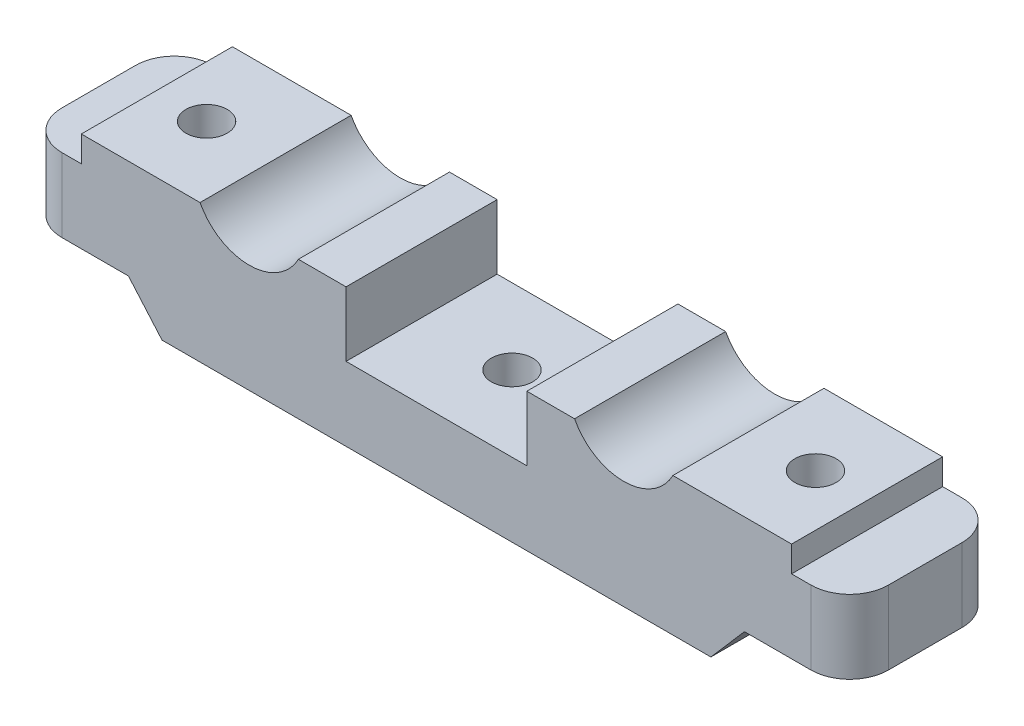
ISO-10303-21;
HEADER;
FILE_DESCRIPTION(('STEP AP214'),'2;1');
FILE_NAME('part.step','',(''),(''),'','','');
FILE_SCHEMA(('AUTOMOTIVE_DESIGN { 1 0 10303 214 1 1 1 1 }'));
ENDSEC;
DATA;
#1=APPLICATION_CONTEXT('core data for automotive mechanical design processes');
#2=APPLICATION_PROTOCOL_DEFINITION('international standard','automotive_design',2000,#1);
#3=PRODUCT_CONTEXT('',#1,'mechanical');
#4=PRODUCT('Part','Part','',(#3));
#5=PRODUCT_RELATED_PRODUCT_CATEGORY('part','',(#4));
#6=PRODUCT_DEFINITION_FORMATION('','',#4);
#7=PRODUCT_DEFINITION_CONTEXT('part definition',#1,'design');
#8=PRODUCT_DEFINITION('design','',#6,#7);
#9=PRODUCT_DEFINITION_SHAPE('','',#8);
#10=(LENGTH_UNIT() NAMED_UNIT(*) SI_UNIT(.MILLI.,.METRE.));
#11=(NAMED_UNIT(*) PLANE_ANGLE_UNIT() SI_UNIT($,.RADIAN.));
#12=(NAMED_UNIT(*) SI_UNIT($,.STERADIAN.) SOLID_ANGLE_UNIT());
#13=UNCERTAINTY_MEASURE_WITH_UNIT(LENGTH_MEASURE(1.E-05),#10,'distance_accuracy_value','');
#14=(GEOMETRIC_REPRESENTATION_CONTEXT(3) GLOBAL_UNCERTAINTY_ASSIGNED_CONTEXT((#13)) GLOBAL_UNIT_ASSIGNED_CONTEXT((#10,
#11,#12)) REPRESENTATION_CONTEXT('',''));
#15=CARTESIAN_POINT('',(0.,0.,0.));
#16=DIRECTION('',(0.,0.,1.));
#17=DIRECTION('',(1.,0.,0.));
#18=AXIS2_PLACEMENT_3D('',#15,#16,#17);
#19=CARTESIAN_POINT('',(-23.85,3.,11.7));
#20=DIRECTION('',(0.755689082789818,0.654930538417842,0.));
#21=DIRECTION('',(-0.654930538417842,0.755689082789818,0.));
#22=AXIS2_PLACEMENT_3D('',#19,#20,#21);
#23=PLANE('',#22);
#24=DIRECTION('',(0.,0.,-1.));
#25=VECTOR('',#24,1.);
#26=CARTESIAN_POINT('',(-21.25,0.,11.7));
#27=LINE('',#26,#25);
#28=CARTESIAN_POINT('',(-21.25,0.,3.06273937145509));
#29=VERTEX_POINT('',#28);
#30=CARTESIAN_POINT('',(-21.25,0.,0.));
#31=VERTEX_POINT('',#30);
#32=EDGE_CURVE('E234',#29,#31,#27,.T.);
#33=ORIENTED_EDGE('',*,*,#32,.F.);
#34=CARTESIAN_POINT('',(-23.5,2.59615384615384,5.99999999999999));
#35=DIRECTION('',(0.755689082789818,0.654930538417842,0.));
#36=DIRECTION('',(0.654930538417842,-0.755689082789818,0.));
#37=AXIS2_PLACEMENT_3D('',#34,#35,#36);
#38=ELLIPSE('',#37,5.64945407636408,3.7);
#39=CARTESIAN_POINT('',(-23.85,3.,2.31659125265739));
#40=VERTEX_POINT('',#39);
#41=EDGE_CURVE('E214',#29,#40,#38,.T.);
#42=ORIENTED_EDGE('',*,*,#41,.T.);
#43=DIRECTION('',(0.,0.,-1.));
#44=VECTOR('',#43,1.);
#45=CARTESIAN_POINT('',(-23.85,3.,11.7));
#46=LINE('',#45,#44);
#47=CARTESIAN_POINT('',(-23.85,3.,0.));
#48=VERTEX_POINT('',#47);
#49=EDGE_CURVE('E310',#40,#48,#46,.T.);
#50=ORIENTED_EDGE('',*,*,#49,.T.);
#51=DIRECTION('',(0.654930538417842,-0.755689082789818,0.));
#52=VECTOR('',#51,1.);
#53=CARTESIAN_POINT('',(-23.85,3.,0.));
#54=LINE('',#53,#52);
#55=EDGE_CURVE('E447',#48,#31,#54,.T.);
#56=ORIENTED_EDGE('',*,*,#55,.T.);
#57=EDGE_LOOP('',(#33,#42,#50,#56));
#58=FACE_BOUND('',#57,.T.);
#59=ADVANCED_FACE('F30',(#58),#23,.F.);
#60=CARTESIAN_POINT('',(-23.5,13.,5.99999999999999));
#61=DIRECTION('',(0.,-1.,0.));
#62=DIRECTION('',(0.,0.,-1.));
#63=AXIS2_PLACEMENT_3D('',#60,#61,#62);
#64=CYLINDRICAL_SURFACE('',#63,1.6);
#65=CARTESIAN_POINT('',(-23.5,10.7,5.99999999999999));
#66=DIRECTION('',(0.,-1.,0.));
#67=DIRECTION('',(1.,0.,0.));
#68=AXIS2_PLACEMENT_3D('',#65,#66,#67);
#69=CIRCLE('',#68,1.6);
#70=CARTESIAN_POINT('',(-21.9,10.7,5.99999999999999));
#71=VERTEX_POINT('',#70);
#72=EDGE_CURVE('E246',#71,#71,#69,.T.);
#73=ORIENTED_EDGE('',*,*,#72,.F.);
#74=EDGE_LOOP('',(#73));
#75=FACE_BOUND('',#74,.T.);
#76=CARTESIAN_POINT('',(-23.5,6.,5.99999999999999));
#77=DIRECTION('',(0.,-1.,0.));
#78=DIRECTION('',(1.,0.,0.));
#79=AXIS2_PLACEMENT_3D('',#76,#77,#78);
#80=CIRCLE('',#79,1.6);
#81=CARTESIAN_POINT('',(-21.9,6.,5.99999999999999));
#82=VERTEX_POINT('',#81);
#83=EDGE_CURVE('E227',#82,#82,#80,.F.);
#84=ORIENTED_EDGE('',*,*,#83,.F.);
#85=EDGE_LOOP('',(#84));
#86=FACE_BOUND('',#85,.T.);
#87=ADVANCED_FACE('F478',(#75,#86),#64,.F.);
#88=CARTESIAN_POINT('',(-23.85,3.,11.7));
#89=VERTEX_POINT('',#88);
#90=CARTESIAN_POINT('',(-23.85,3.,9.68340874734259));
#91=VERTEX_POINT('',#90);
#92=EDGE_CURVE('E226',#89,#91,#46,.T.);
#93=ORIENTED_EDGE('',*,*,#92,.T.);
#94=CARTESIAN_POINT('',(-21.25,0.,8.9372606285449));
#95=VERTEX_POINT('',#94);
#96=EDGE_CURVE('E211',#91,#95,#38,.T.);
#97=ORIENTED_EDGE('',*,*,#96,.T.);
#98=CARTESIAN_POINT('',(-21.25,0.,11.7));
#99=VERTEX_POINT('',#98);
#100=EDGE_CURVE('E224',#99,#95,#27,.T.);
#101=ORIENTED_EDGE('',*,*,#100,.F.);
#102=DIRECTION('',(0.654930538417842,-0.755689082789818,0.));
#103=VECTOR('',#102,1.);
#104=CARTESIAN_POINT('',(-23.85,3.,11.7));
#105=LINE('',#104,#103);
#106=EDGE_CURVE('E413',#89,#99,#105,.T.);
#107=ORIENTED_EDGE('',*,*,#106,.F.);
#108=EDGE_LOOP('',(#93,#97,#101,#107));
#109=FACE_BOUND('',#108,.T.);
#110=ADVANCED_FACE('F32',(#109),#23,.F.);
#111=CARTESIAN_POINT('',(-21.25,0.,11.7));
#112=DIRECTION('',(0.,1.,0.));
#113=DIRECTION('',(-1.,0.,0.));
#114=AXIS2_PLACEMENT_3D('',#111,#112,#113);
#115=PLANE('',#114);
#116=CARTESIAN_POINT('',(0.,0.,5.84999999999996));
#117=DIRECTION('',(0.,1.,0.));
#118=DIRECTION('',(-1.,0.,0.));
#119=AXIS2_PLACEMENT_3D('',#116,#117,#118);
#120=CIRCLE('',#119,1.6);
#121=CARTESIAN_POINT('',(-1.6,0.,5.84999999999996));
#122=VERTEX_POINT('',#121);
#123=EDGE_CURVE('E250',#122,#122,#120,.T.);
#124=ORIENTED_EDGE('',*,*,#123,.T.);
#125=EDGE_LOOP('',(#124));
#126=FACE_BOUND('',#125,.T.);
#127=ORIENTED_EDGE('',*,*,#100,.T.);
#128=CARTESIAN_POINT('',(-23.5,0.,5.99999999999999));
#129=DIRECTION('',(0.,-1.,0.));
#130=DIRECTION('',(1.,0.,0.));
#131=AXIS2_PLACEMENT_3D('',#128,#129,#130);
#132=CIRCLE('',#131,3.7);
#133=EDGE_CURVE('E208',#29,#95,#132,.T.);
#134=ORIENTED_EDGE('',*,*,#133,.F.);
#135=ORIENTED_EDGE('',*,*,#32,.T.);
#136=DIRECTION('',(1.,0.,0.));
#137=VECTOR('',#136,1.);
#138=CARTESIAN_POINT('',(-21.25,0.,0.));
#139=LINE('',#138,#137);
#140=CARTESIAN_POINT('',(21.25,0.,0.));
#141=VERTEX_POINT('',#140);
#142=EDGE_CURVE('E377',#31,#141,#139,.T.);
#143=ORIENTED_EDGE('',*,*,#142,.T.);
#144=DIRECTION('',(0.,0.,-1.));
#145=VECTOR('',#144,1.);
#146=CARTESIAN_POINT('',(21.25,0.,11.7));
#147=LINE('',#146,#145);
#148=CARTESIAN_POINT('',(21.25,0.,11.7));
#149=VERTEX_POINT('',#148);
#150=EDGE_CURVE('E238',#149,#141,#147,.T.);
#151=ORIENTED_EDGE('',*,*,#150,.F.);
#152=DIRECTION('',(1.,0.,0.));
#153=VECTOR('',#152,1.);
#154=CARTESIAN_POINT('',(-21.25,0.,11.7));
#155=LINE('',#154,#153);
#156=EDGE_CURVE('E231',#99,#149,#155,.T.);
#157=ORIENTED_EDGE('',*,*,#156,.F.);
#158=EDGE_LOOP('',(#127,#134,#135,#143,#151,#157));
#159=FACE_BOUND('',#158,.T.);
#160=ADVANCED_FACE('F229',(#126,#159),#115,.F.);
#161=CARTESIAN_POINT('',(21.25,0.,11.7));
#162=DIRECTION('',(-0.755689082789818,0.654930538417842,0.));
#163=DIRECTION('',(-0.654930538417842,-0.755689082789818,0.));
#164=AXIS2_PLACEMENT_3D('',#161,#162,#163);
#165=PLANE('',#164);
#166=DIRECTION('',(0.,0.,-1.));
#167=VECTOR('',#166,1.);
#168=CARTESIAN_POINT('',(23.85,3.00000000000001,11.7));
#169=LINE('',#168,#167);
#170=CARTESIAN_POINT('',(23.85,3.00000000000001,4.2887505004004));
#171=VERTEX_POINT('',#170);
#172=CARTESIAN_POINT('',(23.85,3.00000000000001,0.));
#173=VERTEX_POINT('',#172);
#174=EDGE_CURVE('E353',#171,#173,#169,.T.);
#175=ORIENTED_EDGE('',*,*,#174,.F.);
#176=CARTESIAN_POINT('',(23.5,2.59615384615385,5.85));
#177=DIRECTION('',(-0.755689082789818,0.654930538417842,0.));
#178=DIRECTION('',(-0.654930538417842,-0.755689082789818,0.));
#179=AXIS2_PLACEMENT_3D('',#176,#177,#178);
#180=ELLIPSE('',#179,2.44300716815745,1.6);
#181=CARTESIAN_POINT('',(23.85,3.00000000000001,7.4112494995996));
#182=VERTEX_POINT('',#181);
#183=EDGE_CURVE('E450',#171,#182,#180,.T.);
#184=ORIENTED_EDGE('',*,*,#183,.T.);
#185=CARTESIAN_POINT('',(23.85,3.00000000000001,11.7));
#186=VERTEX_POINT('',#185);
#187=EDGE_CURVE('E354',#186,#182,#169,.T.);
#188=ORIENTED_EDGE('',*,*,#187,.F.);
#189=DIRECTION('',(0.654930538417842,0.755689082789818,0.));
#190=VECTOR('',#189,1.);
#191=CARTESIAN_POINT('',(21.25,0.,11.7));
#192=LINE('',#191,#190);
#193=EDGE_CURVE('E416',#149,#186,#192,.T.);
#194=ORIENTED_EDGE('',*,*,#193,.F.);
#195=ORIENTED_EDGE('',*,*,#150,.T.);
#196=DIRECTION('',(0.654930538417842,0.755689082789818,0.));
#197=VECTOR('',#196,1.);
#198=CARTESIAN_POINT('',(21.25,0.,0.));
#199=LINE('',#198,#197);
#200=EDGE_CURVE('E372',#141,#173,#199,.T.);
#201=ORIENTED_EDGE('',*,*,#200,.T.);
#202=EDGE_LOOP('',(#175,#184,#188,#194,#195,#201));
#203=FACE_BOUND('',#202,.T.);
#204=ADVANCED_FACE('F373',(#203),#165,.F.);
#205=CARTESIAN_POINT('',(23.85,3.00000000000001,11.7));
#206=DIRECTION('',(0.,1.,0.));
#207=DIRECTION('',(-1.,0.,0.));
#208=AXIS2_PLACEMENT_3D('',#205,#206,#207);
#209=PLANE('',#208);
#210=DIRECTION('',(0.,0.,-1.));
#211=VECTOR('',#210,1.);
#212=CARTESIAN_POINT('',(32.,3.00000000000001,11.7));
#213=LINE('',#212,#211);
#214=CARTESIAN_POINT('',(32.,3.00000000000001,8.7));
#215=VERTEX_POINT('',#214);
#216=CARTESIAN_POINT('',(32.,3.00000000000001,3.));
#217=VERTEX_POINT('',#216);
#218=EDGE_CURVE('E351',#215,#217,#213,.T.);
#219=ORIENTED_EDGE('',*,*,#218,.F.);
#220=CARTESIAN_POINT('',(29.,3.00000000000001,8.7));
#221=DIRECTION('',(0.,1.,0.));
#222=DIRECTION('',(-1.,0.,0.));
#223=AXIS2_PLACEMENT_3D('',#220,#221,#222);
#224=CIRCLE('',#223,3.);
#225=CARTESIAN_POINT('',(29.,3.00000000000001,11.7));
#226=VERTEX_POINT('',#225);
#227=EDGE_CURVE('E269',#215,#226,#224,.F.);
#228=ORIENTED_EDGE('',*,*,#227,.T.);
#229=DIRECTION('',(1.,0.,0.));
#230=VECTOR('',#229,1.);
#231=CARTESIAN_POINT('',(23.85,3.00000000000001,11.7));
#232=LINE('',#231,#230);
#233=EDGE_CURVE('E418',#186,#226,#232,.T.);
#234=ORIENTED_EDGE('',*,*,#233,.F.);
#235=ORIENTED_EDGE('',*,*,#187,.T.);
#236=CARTESIAN_POINT('',(23.5,3.00000000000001,5.85));
#237=DIRECTION('',(0.,1.,0.));
#238=DIRECTION('',(-1.,0.,0.));
#239=AXIS2_PLACEMENT_3D('',#236,#237,#238);
#240=CIRCLE('',#239,1.6);
#241=EDGE_CURVE('E245',#182,#171,#240,.T.);
#242=ORIENTED_EDGE('',*,*,#241,.T.);
#243=ORIENTED_EDGE('',*,*,#174,.T.);
#244=DIRECTION('',(1.,0.,0.));
#245=VECTOR('',#244,1.);
#246=CARTESIAN_POINT('',(23.85,3.00000000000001,0.));
#247=LINE('',#246,#245);
#248=CARTESIAN_POINT('',(29.,3.00000000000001,0.));
#249=VERTEX_POINT('',#248);
#250=EDGE_CURVE('E367',#173,#249,#247,.T.);
#251=ORIENTED_EDGE('',*,*,#250,.T.);
#252=CARTESIAN_POINT('',(29.,3.00000000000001,3.));
#253=DIRECTION('',(0.,1.,0.));
#254=DIRECTION('',(-1.,0.,0.));
#255=AXIS2_PLACEMENT_3D('',#252,#253,#254);
#256=CIRCLE('',#255,3.);
#257=EDGE_CURVE('E267',#249,#217,#256,.F.);
#258=ORIENTED_EDGE('',*,*,#257,.T.);
#259=EDGE_LOOP('',(#219,#228,#234,#235,#242,#243,#251,#258));
#260=FACE_BOUND('',#259,.T.);
#261=ADVANCED_FACE('F365',(#260),#209,.F.);
#262=CARTESIAN_POINT('',(32.,3.00000000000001,11.7));
#263=DIRECTION('',(-1.,0.,0.));
#264=DIRECTION('',(0.,0.,1.));
#265=AXIS2_PLACEMENT_3D('',#262,#263,#264);
#266=PLANE('',#265);
#267=DIRECTION('',(0.,0.,-1.));
#268=VECTOR('',#267,1.);
#269=CARTESIAN_POINT('',(32.,8.70000000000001,11.7));
#270=LINE('',#269,#268);
#271=CARTESIAN_POINT('',(32.,8.70000000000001,8.7));
#272=VERTEX_POINT('',#271);
#273=CARTESIAN_POINT('',(32.,8.70000000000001,3.));
#274=VERTEX_POINT('',#273);
#275=EDGE_CURVE('E348',#272,#274,#270,.T.);
#276=ORIENTED_EDGE('',*,*,#275,.F.);
#277=DIRECTION('',(0.,1.,0.));
#278=VECTOR('',#277,1.);
#279=CARTESIAN_POINT('',(32.,12.7,8.7));
#280=LINE('',#279,#278);
#281=EDGE_CURVE('E265',#272,#215,#280,.F.);
#282=ORIENTED_EDGE('',*,*,#281,.T.);
#283=ORIENTED_EDGE('',*,*,#218,.T.);
#284=DIRECTION('',(0.,1.,0.));
#285=VECTOR('',#284,1.);
#286=CARTESIAN_POINT('',(32.,3.00000000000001,3.));
#287=LINE('',#286,#285);
#288=EDGE_CURVE('E262',#217,#274,#287,.T.);
#289=ORIENTED_EDGE('',*,*,#288,.T.);
#290=EDGE_LOOP('',(#276,#282,#283,#289));
#291=FACE_BOUND('',#290,.T.);
#292=ADVANCED_FACE('F496',(#291),#266,.F.);
#293=CARTESIAN_POINT('',(32.,8.70000000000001,11.7));
#294=DIRECTION('',(0.,-1.,0.));
#295=DIRECTION('',(1.,0.,0.));
#296=AXIS2_PLACEMENT_3D('',#293,#294,#295);
#297=PLANE('',#296);
#298=DIRECTION('',(-1.,0.,0.));
#299=VECTOR('',#298,1.);
#300=CARTESIAN_POINT('',(32.,8.70000000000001,11.7));
#301=LINE('',#300,#299);
#302=CARTESIAN_POINT('',(29.,8.70000000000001,11.7));
#303=VERTEX_POINT('',#302);
#304=CARTESIAN_POINT('',(27.5,8.70000000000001,11.7));
#305=VERTEX_POINT('',#304);
#306=EDGE_CURVE('E420',#303,#305,#301,.T.);
#307=ORIENTED_EDGE('',*,*,#306,.F.);
#308=CARTESIAN_POINT('',(29.,8.70000000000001,8.7));
#309=DIRECTION('',(0.,-1.,0.));
#310=DIRECTION('',(1.,0.,0.));
#311=AXIS2_PLACEMENT_3D('',#308,#309,#310);
#312=CIRCLE('',#311,3.);
#313=EDGE_CURVE('E260',#303,#272,#312,.F.);
#314=ORIENTED_EDGE('',*,*,#313,.T.);
#315=ORIENTED_EDGE('',*,*,#275,.T.);
#316=CARTESIAN_POINT('',(29.,8.70000000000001,3.));
#317=DIRECTION('',(0.,-1.,0.));
#318=DIRECTION('',(1.,0.,0.));
#319=AXIS2_PLACEMENT_3D('',#316,#317,#318);
#320=CIRCLE('',#319,3.);
#321=CARTESIAN_POINT('',(29.,8.70000000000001,0.));
#322=VERTEX_POINT('',#321);
#323=EDGE_CURVE('E258',#274,#322,#320,.F.);
#324=ORIENTED_EDGE('',*,*,#323,.T.);
#325=DIRECTION('',(-1.,0.,0.));
#326=VECTOR('',#325,1.);
#327=CARTESIAN_POINT('',(32.,8.70000000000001,0.));
#328=LINE('',#327,#326);
#329=CARTESIAN_POINT('',(27.5,8.70000000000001,0.));
#330=VERTEX_POINT('',#329);
#331=EDGE_CURVE('E382',#322,#330,#328,.T.);
#332=ORIENTED_EDGE('',*,*,#331,.T.);
#333=DIRECTION('',(0.,0.,-1.));
#334=VECTOR('',#333,1.);
#335=CARTESIAN_POINT('',(27.5,8.70000000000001,11.7));
#336=LINE('',#335,#334);
#337=EDGE_CURVE('E345',#305,#330,#336,.T.);
#338=ORIENTED_EDGE('',*,*,#337,.F.);
#339=EDGE_LOOP('',(#307,#314,#315,#324,#332,#338));
#340=FACE_BOUND('',#339,.T.);
#341=ADVANCED_FACE('F499',(#340),#297,.F.);
#342=CARTESIAN_POINT('',(27.5,8.70000000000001,11.7));
#343=DIRECTION('',(-1.,0.,0.));
#344=DIRECTION('',(0.,-1.,0.));
#345=AXIS2_PLACEMENT_3D('',#342,#343,#344);
#346=PLANE('',#345);
#347=DIRECTION('',(0.,1.,0.));
#348=VECTOR('',#347,1.);
#349=CARTESIAN_POINT('',(27.5,8.70000000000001,0.));
#350=LINE('',#349,#348);
#351=CARTESIAN_POINT('',(27.5,10.7,0.));
#352=VERTEX_POINT('',#351);
#353=EDGE_CURVE('E384',#330,#352,#350,.T.);
#354=ORIENTED_EDGE('',*,*,#353,.T.);
#355=DIRECTION('',(0.,0.,-1.));
#356=VECTOR('',#355,1.);
#357=CARTESIAN_POINT('',(27.5,10.7,11.7));
#358=LINE('',#357,#356);
#359=CARTESIAN_POINT('',(27.5,10.7,11.7));
#360=VERTEX_POINT('',#359);
#361=EDGE_CURVE('E342',#360,#352,#358,.T.);
#362=ORIENTED_EDGE('',*,*,#361,.F.);
#363=DIRECTION('',(0.,1.,0.));
#364=VECTOR('',#363,1.);
#365=CARTESIAN_POINT('',(27.5,8.70000000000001,11.7));
#366=LINE('',#365,#364);
#367=EDGE_CURVE('E422',#305,#360,#366,.T.);
#368=ORIENTED_EDGE('',*,*,#367,.F.);
#369=ORIENTED_EDGE('',*,*,#337,.T.);
#370=EDGE_LOOP('',(#354,#362,#368,#369));
#371=FACE_BOUND('',#370,.T.);
#372=ADVANCED_FACE('F503',(#371),#346,.F.);
#373=CARTESIAN_POINT('',(27.5,10.7,11.7));
#374=DIRECTION('',(0.,-1.,0.));
#375=DIRECTION('',(1.,0.,0.));
#376=AXIS2_PLACEMENT_3D('',#373,#374,#375);
#377=PLANE('',#376);
#378=CARTESIAN_POINT('',(23.5,10.7,5.85));
#379=DIRECTION('',(0.,-1.,0.));
#380=DIRECTION('',(1.,0.,0.));
#381=AXIS2_PLACEMENT_3D('',#378,#379,#380);
#382=CIRCLE('',#381,1.6);
#383=CARTESIAN_POINT('',(25.1,10.7,5.85));
#384=VERTEX_POINT('',#383);
#385=EDGE_CURVE('E242',#384,#384,#382,.T.);
#386=ORIENTED_EDGE('',*,*,#385,.T.);
#387=EDGE_LOOP('',(#386));
#388=FACE_BOUND('',#387,.T.);
#389=DIRECTION('',(-1.,0.,0.));
#390=VECTOR('',#389,1.);
#391=CARTESIAN_POINT('',(27.5,10.7,0.));
#392=LINE('',#391,#390);
#393=CARTESIAN_POINT('',(18.3065732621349,10.7,0.));
#394=VERTEX_POINT('',#393);
#395=EDGE_CURVE('E389',#352,#394,#392,.T.);
#396=ORIENTED_EDGE('',*,*,#395,.T.);
#397=DIRECTION('',(0.,0.,-1.));
#398=VECTOR('',#397,1.);
#399=CARTESIAN_POINT('',(18.3065732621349,10.7,11.7));
#400=LINE('',#399,#398);
#401=CARTESIAN_POINT('',(18.3065732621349,10.7,11.7));
#402=VERTEX_POINT('',#401);
#403=EDGE_CURVE('E339',#402,#394,#400,.T.);
#404=ORIENTED_EDGE('',*,*,#403,.F.);
#405=DIRECTION('',(-1.,0.,0.));
#406=VECTOR('',#405,1.);
#407=CARTESIAN_POINT('',(27.5,10.7,11.7));
#408=LINE('',#407,#406);
#409=EDGE_CURVE('E424',#360,#402,#408,.T.);
#410=ORIENTED_EDGE('',*,*,#409,.F.);
#411=ORIENTED_EDGE('',*,*,#361,.T.);
#412=EDGE_LOOP('',(#396,#404,#410,#411));
#413=FACE_BOUND('',#412,.T.);
#414=ADVANCED_FACE('F507',(#388,#413),#377,.F.);
#415=CARTESIAN_POINT('',(14.5,12.7,11.7));
#416=DIRECTION('',(0.,0.,-1.));
#417=DIRECTION('',(-1.,0.,0.));
#418=AXIS2_PLACEMENT_3D('',#415,#416,#417);
#419=CYLINDRICAL_SURFACE('',#418,4.30000000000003);
#420=CARTESIAN_POINT('',(14.5,12.7,0.));
#421=DIRECTION('',(0.,0.,-1.));
#422=DIRECTION('',(1.,0.,0.));
#423=AXIS2_PLACEMENT_3D('',#420,#421,#422);
#424=CIRCLE('',#423,4.30000000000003);
#425=CARTESIAN_POINT('',(10.6934267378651,10.7,0.));
#426=VERTEX_POINT('',#425);
#427=EDGE_CURVE('E391',#394,#426,#424,.T.);
#428=ORIENTED_EDGE('',*,*,#427,.T.);
#429=DIRECTION('',(0.,0.,-1.));
#430=VECTOR('',#429,1.);
#431=CARTESIAN_POINT('',(10.6934267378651,10.7,11.7));
#432=LINE('',#431,#430);
#433=CARTESIAN_POINT('',(10.6934267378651,10.7,11.7));
#434=VERTEX_POINT('',#433);
#435=EDGE_CURVE('E336',#434,#426,#432,.T.);
#436=ORIENTED_EDGE('',*,*,#435,.F.);
#437=CARTESIAN_POINT('',(14.5,12.7,11.7));
#438=DIRECTION('',(0.,0.,-1.));
#439=DIRECTION('',(1.,0.,0.));
#440=AXIS2_PLACEMENT_3D('',#437,#438,#439);
#441=CIRCLE('',#440,4.30000000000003);
#442=EDGE_CURVE('E426',#402,#434,#441,.T.);
#443=ORIENTED_EDGE('',*,*,#442,.F.);
#444=ORIENTED_EDGE('',*,*,#403,.T.);
#445=EDGE_LOOP('',(#428,#436,#443,#444));
#446=FACE_BOUND('',#445,.T.);
#447=ADVANCED_FACE('F511',(#446),#419,.F.);
#448=CARTESIAN_POINT('',(10.6934267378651,10.7,11.7));
#449=DIRECTION('',(0.,-1.,0.));
#450=DIRECTION('',(1.,0.,0.));
#451=AXIS2_PLACEMENT_3D('',#448,#449,#450);
#452=PLANE('',#451);
#453=DIRECTION('',(-1.,0.,0.));
#454=VECTOR('',#453,1.);
#455=CARTESIAN_POINT('',(10.6934267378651,10.7,0.));
#456=LINE('',#455,#454);
#457=CARTESIAN_POINT('',(7.,10.7,0.));
#458=VERTEX_POINT('',#457);
#459=EDGE_CURVE('E393',#426,#458,#456,.T.);
#460=ORIENTED_EDGE('',*,*,#459,.T.);
#461=DIRECTION('',(0.,0.,-1.));
#462=VECTOR('',#461,1.);
#463=CARTESIAN_POINT('',(7.,10.7,11.7));
#464=LINE('',#463,#462);
#465=CARTESIAN_POINT('',(7.,10.7,11.7));
#466=VERTEX_POINT('',#465);
#467=EDGE_CURVE('E333',#466,#458,#464,.T.);
#468=ORIENTED_EDGE('',*,*,#467,.F.);
#469=DIRECTION('',(-1.,0.,0.));
#470=VECTOR('',#469,1.);
#471=CARTESIAN_POINT('',(10.6934267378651,10.7,11.7));
#472=LINE('',#471,#470);
#473=EDGE_CURVE('E428',#434,#466,#472,.T.);
#474=ORIENTED_EDGE('',*,*,#473,.F.);
#475=ORIENTED_EDGE('',*,*,#435,.T.);
#476=EDGE_LOOP('',(#460,#468,#474,#475));
#477=FACE_BOUND('',#476,.T.);
#478=ADVANCED_FACE('F515',(#477),#452,.F.);
#479=CARTESIAN_POINT('',(7.,10.7,11.7));
#480=DIRECTION('',(1.,0.,0.));
#481=DIRECTION('',(0.,1.,0.));
#482=AXIS2_PLACEMENT_3D('',#479,#480,#481);
#483=PLANE('',#482);
#484=DIRECTION('',(0.,-1.,0.));
#485=VECTOR('',#484,1.);
#486=CARTESIAN_POINT('',(7.,10.7,0.));
#487=LINE('',#486,#485);
#488=CARTESIAN_POINT('',(7.,5.69999999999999,0.));
#489=VERTEX_POINT('',#488);
#490=EDGE_CURVE('E395',#458,#489,#487,.T.);
#491=ORIENTED_EDGE('',*,*,#490,.T.);
#492=DIRECTION('',(0.,0.,-1.));
#493=VECTOR('',#492,1.);
#494=CARTESIAN_POINT('',(7.,5.69999999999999,11.7));
#495=LINE('',#494,#493);
#496=CARTESIAN_POINT('',(7.,5.69999999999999,11.7));
#497=VERTEX_POINT('',#496);
#498=EDGE_CURVE('E330',#497,#489,#495,.T.);
#499=ORIENTED_EDGE('',*,*,#498,.F.);
#500=DIRECTION('',(0.,-1.,0.));
#501=VECTOR('',#500,1.);
#502=CARTESIAN_POINT('',(7.,10.7,11.7));
#503=LINE('',#502,#501);
#504=EDGE_CURVE('E430',#466,#497,#503,.T.);
#505=ORIENTED_EDGE('',*,*,#504,.F.);
#506=ORIENTED_EDGE('',*,*,#467,.T.);
#507=EDGE_LOOP('',(#491,#499,#505,#506));
#508=FACE_BOUND('',#507,.T.);
#509=ADVANCED_FACE('F519',(#508),#483,.F.);
#510=CARTESIAN_POINT('',(7.,5.69999999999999,11.7));
#511=DIRECTION('',(0.,-1.,0.));
#512=DIRECTION('',(1.,0.,0.));
#513=AXIS2_PLACEMENT_3D('',#510,#511,#512);
#514=PLANE('',#513);
#515=CARTESIAN_POINT('',(0.,5.69999999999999,5.84999999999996));
#516=DIRECTION('',(0.,-1.,0.));
#517=DIRECTION('',(1.,0.,0.));
#518=AXIS2_PLACEMENT_3D('',#515,#516,#517);
#519=CIRCLE('',#518,1.6);
#520=CARTESIAN_POINT('',(1.6,5.69999999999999,5.84999999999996));
#521=VERTEX_POINT('',#520);
#522=EDGE_CURVE('E247',#521,#521,#519,.T.);
#523=ORIENTED_EDGE('',*,*,#522,.T.);
#524=EDGE_LOOP('',(#523));
#525=FACE_BOUND('',#524,.T.);
#526=DIRECTION('',(-1.,0.,0.));
#527=VECTOR('',#526,1.);
#528=CARTESIAN_POINT('',(7.,5.69999999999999,0.));
#529=LINE('',#528,#527);
#530=CARTESIAN_POINT('',(-7.,5.69999999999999,0.));
#531=VERTEX_POINT('',#530);
#532=EDGE_CURVE('E397',#489,#531,#529,.T.);
#533=ORIENTED_EDGE('',*,*,#532,.T.);
#534=DIRECTION('',(0.,0.,-1.));
#535=VECTOR('',#534,1.);
#536=CARTESIAN_POINT('',(-7.,5.69999999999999,11.7));
#537=LINE('',#536,#535);
#538=CARTESIAN_POINT('',(-7.,5.69999999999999,11.7));
#539=VERTEX_POINT('',#538);
#540=EDGE_CURVE('E327',#539,#531,#537,.T.);
#541=ORIENTED_EDGE('',*,*,#540,.F.);
#542=DIRECTION('',(-1.,0.,0.));
#543=VECTOR('',#542,1.);
#544=CARTESIAN_POINT('',(7.,5.69999999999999,11.7));
#545=LINE('',#544,#543);
#546=EDGE_CURVE('E432',#497,#539,#545,.T.);
#547=ORIENTED_EDGE('',*,*,#546,.F.);
#548=ORIENTED_EDGE('',*,*,#498,.T.);
#549=EDGE_LOOP('',(#533,#541,#547,#548));
#550=FACE_BOUND('',#549,.T.);
#551=ADVANCED_FACE('F523',(#525,#550),#514,.F.);
#552=CARTESIAN_POINT('',(-7.,5.69999999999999,11.7));
#553=DIRECTION('',(-1.,0.,0.));
#554=DIRECTION('',(0.,-1.,0.));
#555=AXIS2_PLACEMENT_3D('',#552,#553,#554);
#556=PLANE('',#555);
#557=DIRECTION('',(0.,1.,0.));
#558=VECTOR('',#557,1.);
#559=CARTESIAN_POINT('',(-7.,5.69999999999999,0.));
#560=LINE('',#559,#558);
#561=CARTESIAN_POINT('',(-7.,10.7,0.));
#562=VERTEX_POINT('',#561);
#563=EDGE_CURVE('E399',#531,#562,#560,.T.);
#564=ORIENTED_EDGE('',*,*,#563,.T.);
#565=DIRECTION('',(0.,0.,-1.));
#566=VECTOR('',#565,1.);
#567=CARTESIAN_POINT('',(-7.,10.7,11.7));
#568=LINE('',#567,#566);
#569=CARTESIAN_POINT('',(-7.,10.7,11.7));
#570=VERTEX_POINT('',#569);
#571=EDGE_CURVE('E324',#570,#562,#568,.T.);
#572=ORIENTED_EDGE('',*,*,#571,.F.);
#573=DIRECTION('',(0.,1.,0.));
#574=VECTOR('',#573,1.);
#575=CARTESIAN_POINT('',(-7.,5.69999999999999,11.7));
#576=LINE('',#575,#574);
#577=EDGE_CURVE('E434',#539,#570,#576,.T.);
#578=ORIENTED_EDGE('',*,*,#577,.F.);
#579=ORIENTED_EDGE('',*,*,#540,.T.);
#580=EDGE_LOOP('',(#564,#572,#578,#579));
#581=FACE_BOUND('',#580,.T.);
#582=ADVANCED_FACE('F527',(#581),#556,.F.);
#583=CARTESIAN_POINT('',(-7.,10.7,11.7));
#584=DIRECTION('',(0.,-1.,0.));
#585=DIRECTION('',(1.,0.,0.));
#586=AXIS2_PLACEMENT_3D('',#583,#584,#585);
#587=PLANE('',#586);
#588=DIRECTION('',(-1.,0.,0.));
#589=VECTOR('',#588,1.);
#590=CARTESIAN_POINT('',(-7.,10.7,0.));
#591=LINE('',#590,#589);
#592=CARTESIAN_POINT('',(-10.6934267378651,10.7,0.));
#593=VERTEX_POINT('',#592);
#594=EDGE_CURVE('E401',#562,#593,#591,.T.);
#595=ORIENTED_EDGE('',*,*,#594,.T.);
#596=DIRECTION('',(0.,0.,-1.));
#597=VECTOR('',#596,1.);
#598=CARTESIAN_POINT('',(-10.6934267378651,10.7,11.7));
#599=LINE('',#598,#597);
#600=CARTESIAN_POINT('',(-10.6934267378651,10.7,11.7));
#601=VERTEX_POINT('',#600);
#602=EDGE_CURVE('E321',#601,#593,#599,.T.);
#603=ORIENTED_EDGE('',*,*,#602,.F.);
#604=DIRECTION('',(-1.,0.,0.));
#605=VECTOR('',#604,1.);
#606=CARTESIAN_POINT('',(-7.,10.7,11.7));
#607=LINE('',#606,#605);
#608=EDGE_CURVE('E436',#570,#601,#607,.T.);
#609=ORIENTED_EDGE('',*,*,#608,.F.);
#610=ORIENTED_EDGE('',*,*,#571,.T.);
#611=EDGE_LOOP('',(#595,#603,#609,#610));
#612=FACE_BOUND('',#611,.T.);
#613=ADVANCED_FACE('F531',(#612),#587,.F.);
#614=CARTESIAN_POINT('',(-14.5,12.7,11.7));
#615=DIRECTION('',(0.,0.,-1.));
#616=DIRECTION('',(-1.,0.,0.));
#617=AXIS2_PLACEMENT_3D('',#614,#615,#616);
#618=CYLINDRICAL_SURFACE('',#617,4.30000000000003);
#619=CARTESIAN_POINT('',(-14.5,12.7,0.));
#620=DIRECTION('',(0.,0.,-1.));
#621=DIRECTION('',(1.,0.,0.));
#622=AXIS2_PLACEMENT_3D('',#619,#620,#621);
#623=CIRCLE('',#622,4.30000000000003);
#624=CARTESIAN_POINT('',(-18.3065732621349,10.7,0.));
#625=VERTEX_POINT('',#624);
#626=EDGE_CURVE('E403',#593,#625,#623,.T.);
#627=ORIENTED_EDGE('',*,*,#626,.T.);
#628=DIRECTION('',(0.,0.,-1.));
#629=VECTOR('',#628,1.);
#630=CARTESIAN_POINT('',(-18.3065732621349,10.7,11.7));
#631=LINE('',#630,#629);
#632=CARTESIAN_POINT('',(-18.3065732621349,10.7,11.7));
#633=VERTEX_POINT('',#632);
#634=EDGE_CURVE('E318',#633,#625,#631,.T.);
#635=ORIENTED_EDGE('',*,*,#634,.F.);
#636=CARTESIAN_POINT('',(-14.5,12.7,11.7));
#637=DIRECTION('',(0.,0.,-1.));
#638=DIRECTION('',(1.,0.,0.));
#639=AXIS2_PLACEMENT_3D('',#636,#637,#638);
#640=CIRCLE('',#639,4.30000000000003);
#641=EDGE_CURVE('E438',#601,#633,#640,.T.);
#642=ORIENTED_EDGE('',*,*,#641,.F.);
#643=ORIENTED_EDGE('',*,*,#602,.T.);
#644=EDGE_LOOP('',(#627,#635,#642,#643));
#645=FACE_BOUND('',#644,.T.);
#646=ADVANCED_FACE('F535',(#645),#618,.F.);
#647=CARTESIAN_POINT('',(-18.3065732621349,10.7,11.7));
#648=DIRECTION('',(0.,-1.,0.));
#649=DIRECTION('',(1.,0.,0.));
#650=AXIS2_PLACEMENT_3D('',#647,#648,#649);
#651=PLANE('',#650);
#652=ORIENTED_EDGE('',*,*,#72,.T.);
#653=EDGE_LOOP('',(#652));
#654=FACE_BOUND('',#653,.T.);
#655=DIRECTION('',(-1.,0.,0.));
#656=VECTOR('',#655,1.);
#657=CARTESIAN_POINT('',(-18.3065732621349,10.7,0.));
#658=LINE('',#657,#656);
#659=CARTESIAN_POINT('',(-27.5,10.7,0.));
#660=VERTEX_POINT('',#659);
#661=EDGE_CURVE('E405',#625,#660,#658,.T.);
#662=ORIENTED_EDGE('',*,*,#661,.T.);
#663=DIRECTION('',(0.,0.,-1.));
#664=VECTOR('',#663,1.);
#665=CARTESIAN_POINT('',(-27.5,10.7,11.7));
#666=LINE('',#665,#664);
#667=CARTESIAN_POINT('',(-27.5,10.7,11.7));
#668=VERTEX_POINT('',#667);
#669=EDGE_CURVE('E315',#668,#660,#666,.T.);
#670=ORIENTED_EDGE('',*,*,#669,.F.);
#671=DIRECTION('',(-1.,0.,0.));
#672=VECTOR('',#671,1.);
#673=CARTESIAN_POINT('',(-18.3065732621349,10.7,11.7));
#674=LINE('',#673,#672);
#675=EDGE_CURVE('E440',#633,#668,#674,.T.);
#676=ORIENTED_EDGE('',*,*,#675,.F.);
#677=ORIENTED_EDGE('',*,*,#634,.T.);
#678=EDGE_LOOP('',(#662,#670,#676,#677));
#679=FACE_BOUND('',#678,.T.);
#680=ADVANCED_FACE('F539',(#654,#679),#651,.F.);
#681=CARTESIAN_POINT('',(-27.5,10.7,11.7));
#682=DIRECTION('',(1.,0.,0.));
#683=DIRECTION('',(0.,1.,0.));
#684=AXIS2_PLACEMENT_3D('',#681,#682,#683);
#685=PLANE('',#684);
#686=DIRECTION('',(0.,-1.,0.));
#687=VECTOR('',#686,1.);
#688=CARTESIAN_POINT('',(-27.5,10.7,0.));
#689=LINE('',#688,#687);
#690=CARTESIAN_POINT('',(-27.5,8.7,0.));
#691=VERTEX_POINT('',#690);
#692=EDGE_CURVE('E407',#660,#691,#689,.T.);
#693=ORIENTED_EDGE('',*,*,#692,.T.);
#694=DIRECTION('',(0.,0.,-1.));
#695=VECTOR('',#694,1.);
#696=CARTESIAN_POINT('',(-27.5,8.7,11.7));
#697=LINE('',#696,#695);
#698=CARTESIAN_POINT('',(-27.5,8.7,11.7));
#699=VERTEX_POINT('',#698);
#700=EDGE_CURVE('E308',#699,#691,#697,.T.);
#701=ORIENTED_EDGE('',*,*,#700,.F.);
#702=DIRECTION('',(0.,-1.,0.));
#703=VECTOR('',#702,1.);
#704=CARTESIAN_POINT('',(-27.5,10.7,11.7));
#705=LINE('',#704,#703);
#706=EDGE_CURVE('E296',#668,#699,#705,.T.);
#707=ORIENTED_EDGE('',*,*,#706,.F.);
#708=ORIENTED_EDGE('',*,*,#669,.T.);
#709=EDGE_LOOP('',(#693,#701,#707,#708));
#710=FACE_BOUND('',#709,.T.);
#711=ADVANCED_FACE('F543',(#710),#685,.F.);
#712=CARTESIAN_POINT('',(-27.5,8.7,11.7));
#713=DIRECTION('',(0.,-1.,0.));
#714=DIRECTION('',(0.,0.,-1.));
#715=AXIS2_PLACEMENT_3D('',#712,#713,#714);
#716=PLANE('',#715);
#717=DIRECTION('',(-1.,0.,0.));
#718=VECTOR('',#717,1.);
#719=CARTESIAN_POINT('',(-27.5,8.7,0.));
#720=LINE('',#719,#718);
#721=CARTESIAN_POINT('',(-29.,8.7,0.));
#722=VERTEX_POINT('',#721);
#723=EDGE_CURVE('E409',#691,#722,#720,.T.);
#724=ORIENTED_EDGE('',*,*,#723,.T.);
#725=CARTESIAN_POINT('',(-29.,8.7,3.));
#726=DIRECTION('',(0.,-1.,0.));
#727=DIRECTION('',(0.,0.,-1.));
#728=AXIS2_PLACEMENT_3D('',#725,#726,#727);
#729=CIRCLE('',#728,3.);
#730=CARTESIAN_POINT('',(-32.,8.7,3.));
#731=VERTEX_POINT('',#730);
#732=EDGE_CURVE('E11',#722,#731,#729,.F.);
#733=ORIENTED_EDGE('',*,*,#732,.T.);
#734=DIRECTION('',(0.,0.,-1.));
#735=VECTOR('',#734,1.);
#736=CARTESIAN_POINT('',(-32.,8.7,11.7));
#737=LINE('',#736,#735);
#738=CARTESIAN_POINT('',(-32.,8.7,8.7));
#739=VERTEX_POINT('',#738);
#740=EDGE_CURVE('E288',#739,#731,#737,.T.);
#741=ORIENTED_EDGE('',*,*,#740,.F.);
#742=CARTESIAN_POINT('',(-29.,8.7,8.7));
#743=DIRECTION('',(0.,-1.,0.));
#744=DIRECTION('',(0.,0.,-1.));
#745=AXIS2_PLACEMENT_3D('',#742,#743,#744);
#746=CIRCLE('',#745,3.);
#747=CARTESIAN_POINT('',(-29.,8.7,11.7));
#748=VERTEX_POINT('',#747);
#749=EDGE_CURVE('E38',#739,#748,#746,.F.);
#750=ORIENTED_EDGE('',*,*,#749,.T.);
#751=DIRECTION('',(-1.,0.,0.));
#752=VECTOR('',#751,1.);
#753=CARTESIAN_POINT('',(-27.5,8.7,11.7));
#754=LINE('',#753,#752);
#755=EDGE_CURVE('E287',#699,#748,#754,.T.);
#756=ORIENTED_EDGE('',*,*,#755,.F.);
#757=ORIENTED_EDGE('',*,*,#700,.T.);
#758=EDGE_LOOP('',(#724,#733,#741,#750,#756,#757));
#759=FACE_BOUND('',#758,.T.);
#760=ADVANCED_FACE('F285',(#759),#716,.F.);
#761=CARTESIAN_POINT('',(-32.,8.7,11.7));
#762=DIRECTION('',(1.,0.,0.));
#763=DIRECTION('',(0.,0.,-1.));
#764=AXIS2_PLACEMENT_3D('',#761,#762,#763);
#765=PLANE('',#764);
#766=ORIENTED_EDGE('',*,*,#740,.T.);
#767=DIRECTION('',(0.,-1.,0.));
#768=VECTOR('',#767,1.);
#769=CARTESIAN_POINT('',(-32.,8.7,3.));
#770=LINE('',#769,#768);
#771=CARTESIAN_POINT('',(-32.,3.,3.));
#772=VERTEX_POINT('',#771);
#773=EDGE_CURVE('E276',#731,#772,#770,.T.);
#774=ORIENTED_EDGE('',*,*,#773,.T.);
#775=DIRECTION('',(0.,0.,-1.));
#776=VECTOR('',#775,1.);
#777=CARTESIAN_POINT('',(-32.,3.,11.7));
#778=LINE('',#777,#776);
#779=CARTESIAN_POINT('',(-32.,3.,8.7));
#780=VERTEX_POINT('',#779);
#781=EDGE_CURVE('E304',#780,#772,#778,.T.);
#782=ORIENTED_EDGE('',*,*,#781,.F.);
#783=DIRECTION('',(0.,-1.,0.));
#784=VECTOR('',#783,1.);
#785=CARTESIAN_POINT('',(-32.,12.7,8.7));
#786=LINE('',#785,#784);
#787=EDGE_CURVE('E50',#780,#739,#786,.F.);
#788=ORIENTED_EDGE('',*,*,#787,.T.);
#789=EDGE_LOOP('',(#766,#774,#782,#788));
#790=FACE_BOUND('',#789,.T.);
#791=ADVANCED_FACE('F305',(#790),#765,.F.);
#792=CARTESIAN_POINT('',(-32.,3.,11.7));
#793=DIRECTION('',(0.,1.,0.));
#794=DIRECTION('',(0.,0.,1.));
#795=AXIS2_PLACEMENT_3D('',#792,#793,#794);
#796=PLANE('',#795);
#797=ORIENTED_EDGE('',*,*,#781,.T.);
#798=CARTESIAN_POINT('',(-29.,3.,3.));
#799=DIRECTION('',(0.,1.,0.));
#800=DIRECTION('',(0.,0.,1.));
#801=AXIS2_PLACEMENT_3D('',#798,#799,#800);
#802=CIRCLE('',#801,3.);
#803=CARTESIAN_POINT('',(-29.,3.,0.));
#804=VERTEX_POINT('',#803);
#805=EDGE_CURVE('E281',#772,#804,#802,.F.);
#806=ORIENTED_EDGE('',*,*,#805,.T.);
#807=DIRECTION('',(1.,0.,0.));
#808=VECTOR('',#807,1.);
#809=CARTESIAN_POINT('',(-32.,3.,0.));
#810=LINE('',#809,#808);
#811=EDGE_CURVE('E411',#804,#48,#810,.T.);
#812=ORIENTED_EDGE('',*,*,#811,.T.);
#813=ORIENTED_EDGE('',*,*,#49,.F.);
#814=CARTESIAN_POINT('',(-23.5,3.,5.99999999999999));
#815=DIRECTION('',(0.,1.,0.));
#816=DIRECTION('',(0.,0.,1.));
#817=AXIS2_PLACEMENT_3D('',#814,#815,#816);
#818=CIRCLE('',#817,3.7);
#819=EDGE_CURVE('E233',#40,#91,#818,.T.);
#820=ORIENTED_EDGE('',*,*,#819,.T.);
#821=ORIENTED_EDGE('',*,*,#92,.F.);
#822=DIRECTION('',(1.,0.,0.));
#823=VECTOR('',#822,1.);
#824=CARTESIAN_POINT('',(-32.,3.,11.7));
#825=LINE('',#824,#823);
#826=CARTESIAN_POINT('',(-29.,3.,11.7));
#827=VERTEX_POINT('',#826);
#828=EDGE_CURVE('E298',#827,#89,#825,.T.);
#829=ORIENTED_EDGE('',*,*,#828,.F.);
#830=CARTESIAN_POINT('',(-29.,3.,8.7));
#831=DIRECTION('',(0.,1.,0.));
#832=DIRECTION('',(0.,0.,1.));
#833=AXIS2_PLACEMENT_3D('',#830,#831,#832);
#834=CIRCLE('',#833,3.);
#835=EDGE_CURVE('E279',#827,#780,#834,.F.);
#836=ORIENTED_EDGE('',*,*,#835,.T.);
#837=EDGE_LOOP('',(#797,#806,#812,#813,#820,#821,#829,#836));
#838=FACE_BOUND('',#837,.T.);
#839=ADVANCED_FACE('F303',(#838),#796,.F.);
#840=CARTESIAN_POINT('',(14.5,12.7,11.7));
#841=DIRECTION('',(0.,0.,1.));
#842=DIRECTION('',(1.,0.,0.));
#843=AXIS2_PLACEMENT_3D('',#840,#841,#842);
#844=PLANE('',#843);
#845=ORIENTED_EDGE('',*,*,#233,.T.);
#846=DIRECTION('',(0.,1.,0.));
#847=VECTOR('',#846,1.);
#848=CARTESIAN_POINT('',(29.,12.7,11.7));
#849=LINE('',#848,#847);
#850=EDGE_CURVE('E255',#226,#303,#849,.T.);
#851=ORIENTED_EDGE('',*,*,#850,.T.);
#852=ORIENTED_EDGE('',*,*,#306,.T.);
#853=ORIENTED_EDGE('',*,*,#367,.T.);
#854=ORIENTED_EDGE('',*,*,#409,.T.);
#855=ORIENTED_EDGE('',*,*,#442,.T.);
#856=ORIENTED_EDGE('',*,*,#473,.T.);
#857=ORIENTED_EDGE('',*,*,#504,.T.);
#858=ORIENTED_EDGE('',*,*,#546,.T.);
#859=ORIENTED_EDGE('',*,*,#577,.T.);
#860=ORIENTED_EDGE('',*,*,#608,.T.);
#861=ORIENTED_EDGE('',*,*,#641,.T.);
#862=ORIENTED_EDGE('',*,*,#675,.T.);
#863=ORIENTED_EDGE('',*,*,#706,.T.);
#864=ORIENTED_EDGE('',*,*,#755,.T.);
#865=DIRECTION('',(0.,-1.,0.));
#866=VECTOR('',#865,1.);
#867=CARTESIAN_POINT('',(-29.,12.7,11.7));
#868=LINE('',#867,#866);
#869=EDGE_CURVE('E236',#748,#827,#868,.T.);
#870=ORIENTED_EDGE('',*,*,#869,.T.);
#871=ORIENTED_EDGE('',*,*,#828,.T.);
#872=ORIENTED_EDGE('',*,*,#106,.T.);
#873=ORIENTED_EDGE('',*,*,#156,.T.);
#874=ORIENTED_EDGE('',*,*,#193,.T.);
#875=EDGE_LOOP('',(#845,#851,#852,#853,#854,#855,#856,#857,#858,#859,#860,#861,#862,#863,#864,
#870,#871,#872,#873,#874));
#876=FACE_BOUND('',#875,.T.);
#877=ADVANCED_FACE('F293',(#876),#844,.T.);
#878=CARTESIAN_POINT('',(14.5,12.7,0.));
#879=DIRECTION('',(0.,0.,1.));
#880=DIRECTION('',(1.,0.,0.));
#881=AXIS2_PLACEMENT_3D('',#878,#879,#880);
#882=PLANE('',#881);
#883=ORIENTED_EDGE('',*,*,#331,.F.);
#884=DIRECTION('',(0.,1.,0.));
#885=VECTOR('',#884,1.);
#886=CARTESIAN_POINT('',(29.,12.7,0.));
#887=LINE('',#886,#885);
#888=EDGE_CURVE('E273',#322,#249,#887,.F.);
#889=ORIENTED_EDGE('',*,*,#888,.T.);
#890=ORIENTED_EDGE('',*,*,#250,.F.);
#891=ORIENTED_EDGE('',*,*,#200,.F.);
#892=ORIENTED_EDGE('',*,*,#142,.F.);
#893=ORIENTED_EDGE('',*,*,#55,.F.);
#894=ORIENTED_EDGE('',*,*,#811,.F.);
#895=DIRECTION('',(0.,-1.,0.));
#896=VECTOR('',#895,1.);
#897=CARTESIAN_POINT('',(-29.,12.7,0.));
#898=LINE('',#897,#896);
#899=EDGE_CURVE('E271',#804,#722,#898,.F.);
#900=ORIENTED_EDGE('',*,*,#899,.T.);
#901=ORIENTED_EDGE('',*,*,#723,.F.);
#902=ORIENTED_EDGE('',*,*,#692,.F.);
#903=ORIENTED_EDGE('',*,*,#661,.F.);
#904=ORIENTED_EDGE('',*,*,#626,.F.);
#905=ORIENTED_EDGE('',*,*,#594,.F.);
#906=ORIENTED_EDGE('',*,*,#563,.F.);
#907=ORIENTED_EDGE('',*,*,#532,.F.);
#908=ORIENTED_EDGE('',*,*,#490,.F.);
#909=ORIENTED_EDGE('',*,*,#459,.F.);
#910=ORIENTED_EDGE('',*,*,#427,.F.);
#911=ORIENTED_EDGE('',*,*,#395,.F.);
#912=ORIENTED_EDGE('',*,*,#353,.F.);
#913=EDGE_LOOP('',(#883,#889,#890,#891,#892,#893,#894,#900,#901,#902,#903,#904,#905,#906,#907,
#908,#909,#910,#911,#912));
#914=FACE_BOUND('',#913,.T.);
#915=ADVANCED_FACE('F380',(#914),#882,.F.);
#916=CARTESIAN_POINT('',(23.5,13.,5.85));
#917=DIRECTION('',(0.,-1.,0.));
#918=DIRECTION('',(0.,0.,-1.));
#919=AXIS2_PLACEMENT_3D('',#916,#917,#918);
#920=CYLINDRICAL_SURFACE('',#919,1.6);
#921=ORIENTED_EDGE('',*,*,#385,.F.);
#922=EDGE_LOOP('',(#921));
#923=FACE_BOUND('',#922,.T.);
#924=ORIENTED_EDGE('',*,*,#241,.F.);
#925=ORIENTED_EDGE('',*,*,#183,.F.);
#926=EDGE_LOOP('',(#924,#925));
#927=FACE_BOUND('',#926,.T.);
#928=ADVANCED_FACE('F474',(#923,#927),#920,.F.);
#929=CARTESIAN_POINT('',(0.,13.,5.84999999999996));
#930=DIRECTION('',(0.,-1.,0.));
#931=DIRECTION('',(0.,0.,-1.));
#932=AXIS2_PLACEMENT_3D('',#929,#930,#931);
#933=CYLINDRICAL_SURFACE('',#932,1.6);
#934=ORIENTED_EDGE('',*,*,#522,.F.);
#935=EDGE_LOOP('',(#934));
#936=FACE_BOUND('',#935,.T.);
#937=ORIENTED_EDGE('',*,*,#123,.F.);
#938=EDGE_LOOP('',(#937));
#939=FACE_BOUND('',#938,.T.);
#940=ADVANCED_FACE('F466',(#936,#939),#933,.F.);
#941=CARTESIAN_POINT('',(-23.5,6.,5.99999999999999));
#942=DIRECTION('',(0.,-1.,0.));
#943=DIRECTION('',(1.,0.,0.));
#944=AXIS2_PLACEMENT_3D('',#941,#942,#943);
#945=CYLINDRICAL_SURFACE('',#944,3.7);
#946=CARTESIAN_POINT('',(-23.5,6.,5.99999999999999));
#947=DIRECTION('',(0.,-1.,0.));
#948=DIRECTION('',(1.,0.,0.));
#949=AXIS2_PLACEMENT_3D('',#946,#947,#948);
#950=CIRCLE('',#949,3.7);
#951=CARTESIAN_POINT('',(-19.8,6.,5.99999999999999));
#952=VERTEX_POINT('',#951);
#953=EDGE_CURVE('E218',#952,#952,#950,.T.);
#954=ORIENTED_EDGE('',*,*,#953,.F.);
#955=EDGE_LOOP('',(#954));
#956=FACE_BOUND('',#955,.T.);
#957=ORIENTED_EDGE('',*,*,#133,.T.);
#958=ORIENTED_EDGE('',*,*,#96,.F.);
#959=ORIENTED_EDGE('',*,*,#819,.F.);
#960=ORIENTED_EDGE('',*,*,#41,.F.);
#961=EDGE_LOOP('',(#957,#958,#959,#960));
#962=FACE_BOUND('',#961,.T.);
#963=ADVANCED_FACE('F210',(#956,#962),#945,.F.);
#964=CARTESIAN_POINT('',(-23.5,6.,5.99999999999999));
#965=DIRECTION('',(0.,-1.,0.));
#966=DIRECTION('',(1.,0.,0.));
#967=AXIS2_PLACEMENT_3D('',#964,#965,#966);
#968=PLANE('',#967);
#969=ORIENTED_EDGE('',*,*,#953,.T.);
#970=EDGE_LOOP('',(#969));
#971=FACE_BOUND('',#970,.T.);
#972=ORIENTED_EDGE('',*,*,#83,.T.);
#973=EDGE_LOOP('',(#972));
#974=FACE_BOUND('',#973,.T.);
#975=ADVANCED_FACE('F462',(#971,#974),#968,.T.);
#976=CARTESIAN_POINT('',(29.,12.7,8.7));
#977=DIRECTION('',(0.,-1.,0.));
#978=DIRECTION('',(0.,0.,-1.));
#979=AXIS2_PLACEMENT_3D('',#976,#977,#978);
#980=CYLINDRICAL_SURFACE('',#979,3.);
#981=ORIENTED_EDGE('',*,*,#227,.F.);
#982=ORIENTED_EDGE('',*,*,#281,.F.);
#983=ORIENTED_EDGE('',*,*,#313,.F.);
#984=ORIENTED_EDGE('',*,*,#850,.F.);
#985=EDGE_LOOP('',(#981,#982,#983,#984));
#986=FACE_BOUND('',#985,.T.);
#987=ADVANCED_FACE('F472',(#986),#980,.T.);
#988=CARTESIAN_POINT('',(29.,3.00000000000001,3.));
#989=DIRECTION('',(0.,1.,0.));
#990=DIRECTION('',(0.,0.,1.));
#991=AXIS2_PLACEMENT_3D('',#988,#989,#990);
#992=CYLINDRICAL_SURFACE('',#991,3.);
#993=ORIENTED_EDGE('',*,*,#257,.F.);
#994=ORIENTED_EDGE('',*,*,#888,.F.);
#995=ORIENTED_EDGE('',*,*,#323,.F.);
#996=ORIENTED_EDGE('',*,*,#288,.F.);
#997=EDGE_LOOP('',(#993,#994,#995,#996));
#998=FACE_BOUND('',#997,.T.);
#999=ADVANCED_FACE('F573',(#998),#992,.T.);
#1000=CARTESIAN_POINT('',(-29.,8.7,3.));
#1001=DIRECTION('',(0.,-1.,0.));
#1002=DIRECTION('',(0.,0.,-1.));
#1003=AXIS2_PLACEMENT_3D('',#1000,#1001,#1002);
#1004=CYLINDRICAL_SURFACE('',#1003,3.);
#1005=ORIENTED_EDGE('',*,*,#732,.F.);
#1006=ORIENTED_EDGE('',*,*,#899,.F.);
#1007=ORIENTED_EDGE('',*,*,#805,.F.);
#1008=ORIENTED_EDGE('',*,*,#773,.F.);
#1009=EDGE_LOOP('',(#1005,#1006,#1007,#1008));
#1010=FACE_BOUND('',#1009,.T.);
#1011=ADVANCED_FACE('F610',(#1010),#1004,.T.);
#1012=CARTESIAN_POINT('',(-29.,12.7,8.7));
#1013=DIRECTION('',(0.,1.,0.));
#1014=DIRECTION('',(0.,0.,1.));
#1015=AXIS2_PLACEMENT_3D('',#1012,#1013,#1014);
#1016=CYLINDRICAL_SURFACE('',#1015,3.);
#1017=ORIENTED_EDGE('',*,*,#749,.F.);
#1018=ORIENTED_EDGE('',*,*,#787,.F.);
#1019=ORIENTED_EDGE('',*,*,#835,.F.);
#1020=ORIENTED_EDGE('',*,*,#869,.F.);
#1021=EDGE_LOOP('',(#1017,#1018,#1019,#1020));
#1022=FACE_BOUND('',#1021,.T.);
#1023=ADVANCED_FACE('F300',(#1022),#1016,.T.);
#1024=CLOSED_SHELL('',(#59,#87,#110,#160,#204,#261,#292,#341,#372,#414,#447,#478,#509,#551,#582,
#613,#646,#680,#711,#760,#791,#839,#877,#915,#928,#940,#963,#975,#987,#999,#1011,#1023));
#1025=MANIFOLD_SOLID_BREP('B2',#1024);
#1026=ADVANCED_BREP_SHAPE_REPRESENTATION('',(#18,#1025),#14);
#1027=SHAPE_DEFINITION_REPRESENTATION(#9,#1026);
ENDSEC;
END-ISO-10303-21;
